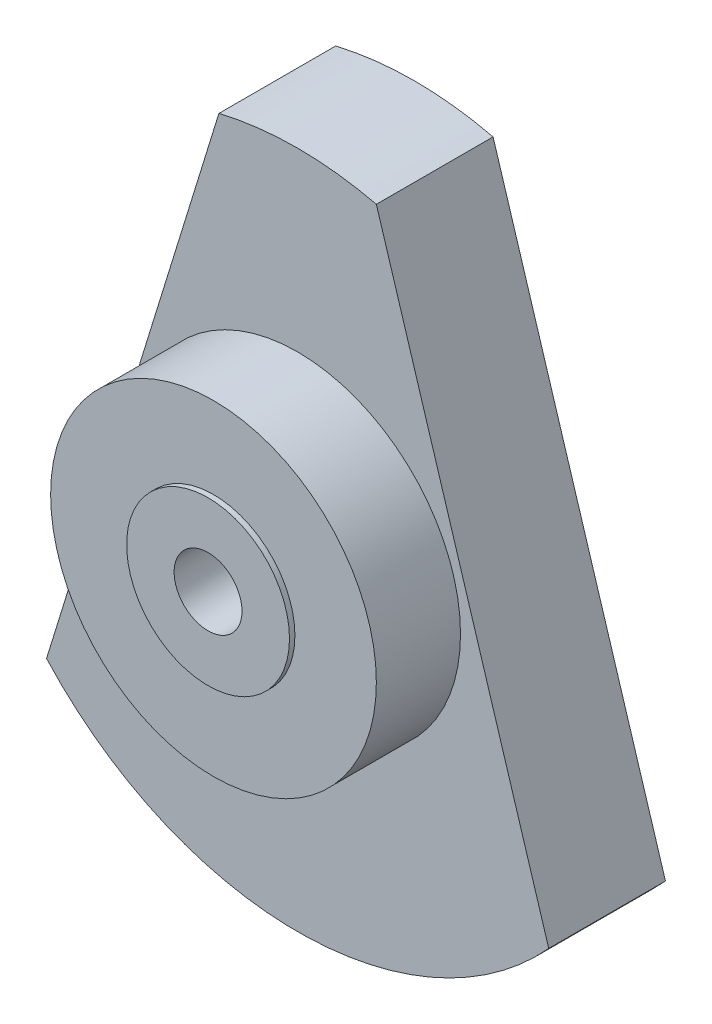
ISO-10303-21;
HEADER;
FILE_DESCRIPTION(('STEP AP214'),'2;1');
FILE_NAME('part.step','',(''),(''),'','','');
FILE_SCHEMA(('AUTOMOTIVE_DESIGN { 1 0 10303 214 1 1 1 1 }'));
ENDSEC;
DATA;
#1=APPLICATION_CONTEXT('core data for automotive mechanical design processes');
#2=APPLICATION_PROTOCOL_DEFINITION('international standard','automotive_design',2000,#1);
#3=PRODUCT_CONTEXT('',#1,'mechanical');
#4=PRODUCT('Part','Part','',(#3));
#5=PRODUCT_RELATED_PRODUCT_CATEGORY('part','',(#4));
#6=PRODUCT_DEFINITION_FORMATION('','',#4);
#7=PRODUCT_DEFINITION_CONTEXT('part definition',#1,'design');
#8=PRODUCT_DEFINITION('design','',#6,#7);
#9=PRODUCT_DEFINITION_SHAPE('','',#8);
#10=(LENGTH_UNIT() NAMED_UNIT(*) SI_UNIT(.MILLI.,.METRE.));
#11=(NAMED_UNIT(*) PLANE_ANGLE_UNIT() SI_UNIT($,.RADIAN.));
#12=(NAMED_UNIT(*) SI_UNIT($,.STERADIAN.) SOLID_ANGLE_UNIT());
#13=UNCERTAINTY_MEASURE_WITH_UNIT(LENGTH_MEASURE(1.E-05),#10,'distance_accuracy_value','');
#14=(GEOMETRIC_REPRESENTATION_CONTEXT(3) GLOBAL_UNCERTAINTY_ASSIGNED_CONTEXT((#13)) GLOBAL_UNIT_ASSIGNED_CONTEXT((#10,
#11,#12)) REPRESENTATION_CONTEXT('',''));
#15=CARTESIAN_POINT('',(0.,0.,0.));
#16=DIRECTION('',(0.,0.,1.));
#17=DIRECTION('',(1.,0.,0.));
#18=AXIS2_PLACEMENT_3D('',#15,#16,#17);
#19=CARTESIAN_POINT('',(0.,0.,3.1));
#20=DIRECTION('',(0.,0.,1.));
#21=DIRECTION('',(1.,0.,0.));
#22=AXIS2_PLACEMENT_3D('',#19,#20,#21);
#23=PLANE('',#22);
#24=CARTESIAN_POINT('',(0.,0.,3.1));
#25=DIRECTION('',(0.,0.,1.));
#26=DIRECTION('',(1.,0.,0.));
#27=AXIS2_PLACEMENT_3D('',#24,#25,#26);
#28=CIRCLE('',#27,6.);
#29=CARTESIAN_POINT('',(6.,0.,3.1));
#30=VERTEX_POINT('',#29);
#31=EDGE_CURVE('E117',#30,#30,#28,.T.);
#32=ORIENTED_EDGE('',*,*,#31,.T.);
#33=EDGE_LOOP('',(#32));
#34=FACE_BOUND('',#33,.T.);
#35=CARTESIAN_POINT('',(0.,0.,3.1));
#36=DIRECTION('',(0.,0.,1.));
#37=DIRECTION('',(1.,0.,0.));
#38=AXIS2_PLACEMENT_3D('',#35,#36,#37);
#39=CIRCLE('',#38,3.);
#40=CARTESIAN_POINT('',(3.,0.,3.1));
#41=VERTEX_POINT('',#40);
#42=EDGE_CURVE('E110',#41,#41,#39,.T.);
#43=ORIENTED_EDGE('',*,*,#42,.F.);
#44=EDGE_LOOP('',(#43));
#45=FACE_BOUND('',#44,.T.);
#46=ADVANCED_FACE('F36',(#34,#45),#23,.T.);
#47=CARTESIAN_POINT('',(0.,0.,0.));
#48=DIRECTION('',(0.,0.,1.));
#49=DIRECTION('',(1.,0.,0.));
#50=AXIS2_PLACEMENT_3D('',#47,#48,#49);
#51=PLANE('',#50);
#52=CARTESIAN_POINT('',(0.,0.,0.));
#53=DIRECTION('',(0.,0.,1.));
#54=DIRECTION('',(1.,0.,0.));
#55=AXIS2_PLACEMENT_3D('',#52,#53,#54);
#56=CIRCLE('',#55,12.5);
#57=CARTESIAN_POINT('',(-9.25,-8.40758586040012,0.));
#58=VERTEX_POINT('',#57);
#59=CARTESIAN_POINT('',(9.25,-8.40758586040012,0.));
#60=VERTEX_POINT('',#59);
#61=EDGE_CURVE('E120',#58,#60,#56,.T.);
#62=ORIENTED_EDGE('',*,*,#61,.T.);
#63=DIRECTION('',(-0.295012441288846,0.955493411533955,0.));
#64=VECTOR('',#63,1.);
#65=CARTESIAN_POINT('',(2.9,12.1589473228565,0.));
#66=LINE('',#65,#64);
#67=CARTESIAN_POINT('',(2.9,12.1589473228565,0.));
#68=VERTEX_POINT('',#67);
#69=EDGE_CURVE('E134',#60,#68,#66,.T.);
#70=ORIENTED_EDGE('',*,*,#69,.T.);
#71=CARTESIAN_POINT('',(0.,0.,0.));
#72=DIRECTION('',(0.,0.,1.));
#73=DIRECTION('',(1.,0.,0.));
#74=AXIS2_PLACEMENT_3D('',#71,#72,#73);
#75=CIRCLE('',#74,12.5);
#76=CARTESIAN_POINT('',(-2.9,12.1589473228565,0.));
#77=VERTEX_POINT('',#76);
#78=EDGE_CURVE('E137',#68,#77,#75,.T.);
#79=ORIENTED_EDGE('',*,*,#78,.T.);
#80=DIRECTION('',(-0.295012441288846,-0.955493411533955,0.));
#81=VECTOR('',#80,1.);
#82=CARTESIAN_POINT('',(-2.9,12.1589473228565,0.));
#83=LINE('',#82,#81);
#84=EDGE_CURVE('E126',#77,#58,#83,.T.);
#85=ORIENTED_EDGE('',*,*,#84,.T.);
#86=EDGE_LOOP('',(#62,#70,#79,#85));
#87=FACE_BOUND('',#86,.T.);
#88=CARTESIAN_POINT('',(0.,0.,0.));
#89=DIRECTION('',(0.,0.,1.));
#90=DIRECTION('',(1.,0.,0.));
#91=AXIS2_PLACEMENT_3D('',#88,#89,#90);
#92=CIRCLE('',#91,6.);
#93=CARTESIAN_POINT('',(6.,0.,0.));
#94=VERTEX_POINT('',#93);
#95=EDGE_CURVE('E114',#94,#94,#92,.T.);
#96=ORIENTED_EDGE('',*,*,#95,.F.);
#97=EDGE_LOOP('',(#96));
#98=FACE_BOUND('',#97,.T.);
#99=ADVANCED_FACE('F144',(#87,#98),#51,.T.);
#100=CARTESIAN_POINT('',(0.,0.,-4.3));
#101=DIRECTION('',(0.,0.,1.));
#102=DIRECTION('',(1.,0.,0.));
#103=AXIS2_PLACEMENT_3D('',#100,#101,#102);
#104=CYLINDRICAL_SURFACE('',#103,12.5);
#105=ORIENTED_EDGE('',*,*,#61,.F.);
#106=DIRECTION('',(0.,0.,1.));
#107=VECTOR('',#106,1.);
#108=CARTESIAN_POINT('',(-9.25,-8.40758586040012,-4.3));
#109=LINE('',#108,#107);
#110=CARTESIAN_POINT('',(-9.25,-8.40758586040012,-4.3));
#111=VERTEX_POINT('',#110);
#112=EDGE_CURVE('E11',#111,#58,#109,.T.);
#113=ORIENTED_EDGE('',*,*,#112,.F.);
#114=CARTESIAN_POINT('',(0.,0.,-4.3));
#115=DIRECTION('',(0.,0.,1.));
#116=DIRECTION('',(1.,0.,0.));
#117=AXIS2_PLACEMENT_3D('',#114,#115,#116);
#118=CIRCLE('',#117,12.5);
#119=CARTESIAN_POINT('',(9.25,-8.40758586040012,-4.3));
#120=VERTEX_POINT('',#119);
#121=EDGE_CURVE('E123',#111,#120,#118,.T.);
#122=ORIENTED_EDGE('',*,*,#121,.T.);
#123=DIRECTION('',(0.,0.,1.));
#124=VECTOR('',#123,1.);
#125=CARTESIAN_POINT('',(9.25,-8.40758586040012,-4.3));
#126=LINE('',#125,#124);
#127=EDGE_CURVE('E40',#120,#60,#126,.T.);
#128=ORIENTED_EDGE('',*,*,#127,.T.);
#129=EDGE_LOOP('',(#105,#113,#122,#128));
#130=FACE_BOUND('',#129,.T.);
#131=ADVANCED_FACE('F38',(#130),#104,.T.);
#132=CARTESIAN_POINT('',(-2.9,12.1589473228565,-4.3));
#133=DIRECTION('',(-0.955493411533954,0.295012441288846,0.));
#134=DIRECTION('',(-0.295012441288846,-0.955493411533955,0.));
#135=AXIS2_PLACEMENT_3D('',#132,#133,#134);
#136=PLANE('',#135);
#137=ORIENTED_EDGE('',*,*,#84,.F.);
#138=DIRECTION('',(0.,0.,1.));
#139=VECTOR('',#138,1.);
#140=CARTESIAN_POINT('',(-2.9,12.1589473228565,-4.3));
#141=LINE('',#140,#139);
#142=CARTESIAN_POINT('',(-2.9,12.1589473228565,-4.3));
#143=VERTEX_POINT('',#142);
#144=EDGE_CURVE('E46',#143,#77,#141,.T.);
#145=ORIENTED_EDGE('',*,*,#144,.F.);
#146=DIRECTION('',(-0.295012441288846,-0.955493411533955,0.));
#147=VECTOR('',#146,1.);
#148=CARTESIAN_POINT('',(-2.9,12.1589473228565,-4.3));
#149=LINE('',#148,#147);
#150=EDGE_CURVE('E130',#143,#111,#149,.T.);
#151=ORIENTED_EDGE('',*,*,#150,.T.);
#152=ORIENTED_EDGE('',*,*,#112,.T.);
#153=EDGE_LOOP('',(#137,#145,#151,#152));
#154=FACE_BOUND('',#153,.T.);
#155=ADVANCED_FACE('F146',(#154),#136,.T.);
#156=CARTESIAN_POINT('',(0.,0.,-4.3));
#157=DIRECTION('',(0.,0.,1.));
#158=DIRECTION('',(1.,0.,0.));
#159=AXIS2_PLACEMENT_3D('',#156,#157,#158);
#160=CYLINDRICAL_SURFACE('',#159,12.5);
#161=ORIENTED_EDGE('',*,*,#78,.F.);
#162=DIRECTION('',(0.,0.,1.));
#163=VECTOR('',#162,1.);
#164=CARTESIAN_POINT('',(2.9,12.1589473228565,-4.3));
#165=LINE('',#164,#163);
#166=CARTESIAN_POINT('',(2.9,12.1589473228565,-4.3));
#167=VERTEX_POINT('',#166);
#168=EDGE_CURVE('E141',#167,#68,#165,.T.);
#169=ORIENTED_EDGE('',*,*,#168,.F.);
#170=CARTESIAN_POINT('',(0.,0.,-4.3));
#171=DIRECTION('',(0.,0.,1.));
#172=DIRECTION('',(1.,0.,0.));
#173=AXIS2_PLACEMENT_3D('',#170,#171,#172);
#174=CIRCLE('',#173,12.5);
#175=EDGE_CURVE('E128',#167,#143,#174,.T.);
#176=ORIENTED_EDGE('',*,*,#175,.T.);
#177=ORIENTED_EDGE('',*,*,#144,.T.);
#178=EDGE_LOOP('',(#161,#169,#176,#177));
#179=FACE_BOUND('',#178,.T.);
#180=ADVANCED_FACE('F149',(#179),#160,.T.);
#181=CARTESIAN_POINT('',(2.9,12.1589473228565,-4.3));
#182=DIRECTION('',(0.955493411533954,0.295012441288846,0.));
#183=DIRECTION('',(-0.295012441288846,0.955493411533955,0.));
#184=AXIS2_PLACEMENT_3D('',#181,#182,#183);
#185=PLANE('',#184);
#186=ORIENTED_EDGE('',*,*,#69,.F.);
#187=ORIENTED_EDGE('',*,*,#127,.F.);
#188=DIRECTION('',(-0.295012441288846,0.955493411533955,0.));
#189=VECTOR('',#188,1.);
#190=CARTESIAN_POINT('',(2.9,12.1589473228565,-4.3));
#191=LINE('',#190,#189);
#192=EDGE_CURVE('E125',#120,#167,#191,.T.);
#193=ORIENTED_EDGE('',*,*,#192,.T.);
#194=ORIENTED_EDGE('',*,*,#168,.T.);
#195=EDGE_LOOP('',(#186,#187,#193,#194));
#196=FACE_BOUND('',#195,.T.);
#197=ADVANCED_FACE('F142',(#196),#185,.T.);
#198=CARTESIAN_POINT('',(0.,0.,-4.3));
#199=DIRECTION('',(0.,0.,1.));
#200=DIRECTION('',(1.,0.,0.));
#201=AXIS2_PLACEMENT_3D('',#198,#199,#200);
#202=PLANE('',#201);
#203=CARTESIAN_POINT('',(0.,9.,-4.3));
#204=DIRECTION('',(0.,0.,-1.));
#205=DIRECTION('',(-1.,0.,0.));
#206=AXIS2_PLACEMENT_3D('',#203,#204,#205);
#207=CIRCLE('',#206,0.999999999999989);
#208=CARTESIAN_POINT('',(-0.999999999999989,9.,-4.3));
#209=VERTEX_POINT('',#208);
#210=EDGE_CURVE('E100',#209,#209,#207,.T.);
#211=ORIENTED_EDGE('',*,*,#210,.F.);
#212=EDGE_LOOP('',(#211));
#213=FACE_BOUND('',#212,.T.);
#214=ORIENTED_EDGE('',*,*,#121,.F.);
#215=ORIENTED_EDGE('',*,*,#150,.F.);
#216=ORIENTED_EDGE('',*,*,#175,.F.);
#217=ORIENTED_EDGE('',*,*,#192,.F.);
#218=EDGE_LOOP('',(#214,#215,#216,#217));
#219=FACE_BOUND('',#218,.T.);
#220=ADVANCED_FACE('F151',(#213,#219),#202,.F.);
#221=CARTESIAN_POINT('',(0.,0.,3.1));
#222=DIRECTION('',(0.,0.,-1.));
#223=DIRECTION('',(-1.,0.,0.));
#224=AXIS2_PLACEMENT_3D('',#221,#222,#223);
#225=CYLINDRICAL_SURFACE('',#224,6.);
#226=ORIENTED_EDGE('',*,*,#31,.F.);
#227=EDGE_LOOP('',(#226));
#228=FACE_BOUND('',#227,.T.);
#229=ORIENTED_EDGE('',*,*,#95,.T.);
#230=EDGE_LOOP('',(#229));
#231=FACE_BOUND('',#230,.T.);
#232=ADVANCED_FACE('F153',(#228,#231),#225,.T.);
#233=CARTESIAN_POINT('',(0.,0.,3.3));
#234=DIRECTION('',(0.,0.,-1.));
#235=DIRECTION('',(-1.,0.,0.));
#236=AXIS2_PLACEMENT_3D('',#233,#234,#235);
#237=CYLINDRICAL_SURFACE('',#236,3.);
#238=CARTESIAN_POINT('',(0.,0.,3.3));
#239=DIRECTION('',(0.,0.,1.));
#240=DIRECTION('',(1.,0.,0.));
#241=AXIS2_PLACEMENT_3D('',#238,#239,#240);
#242=CIRCLE('',#241,3.);
#243=CARTESIAN_POINT('',(3.,0.,3.3));
#244=VERTEX_POINT('',#243);
#245=EDGE_CURVE('E111',#244,#244,#242,.T.);
#246=ORIENTED_EDGE('',*,*,#245,.F.);
#247=EDGE_LOOP('',(#246));
#248=FACE_BOUND('',#247,.T.);
#249=ORIENTED_EDGE('',*,*,#42,.T.);
#250=EDGE_LOOP('',(#249));
#251=FACE_BOUND('',#250,.T.);
#252=ADVANCED_FACE('F160',(#248,#251),#237,.T.);
#253=CARTESIAN_POINT('',(0.,0.,3.3));
#254=DIRECTION('',(0.,0.,1.));
#255=DIRECTION('',(1.,0.,0.));
#256=AXIS2_PLACEMENT_3D('',#253,#254,#255);
#257=PLANE('',#256);
#258=CARTESIAN_POINT('',(0.,0.,3.3));
#259=DIRECTION('',(0.,0.,1.));
#260=DIRECTION('',(1.,0.,0.));
#261=AXIS2_PLACEMENT_3D('',#258,#259,#260);
#262=CIRCLE('',#261,1.25);
#263=CARTESIAN_POINT('',(1.25,0.,3.3));
#264=VERTEX_POINT('',#263);
#265=EDGE_CURVE('E99',#264,#264,#262,.T.);
#266=ORIENTED_EDGE('',*,*,#265,.F.);
#267=EDGE_LOOP('',(#266));
#268=FACE_BOUND('',#267,.T.);
#269=ORIENTED_EDGE('',*,*,#245,.T.);
#270=EDGE_LOOP('',(#269));
#271=FACE_BOUND('',#270,.T.);
#272=ADVANCED_FACE('F175',(#268,#271),#257,.T.);
#273=CARTESIAN_POINT('',(0.,0.,-2.7));
#274=DIRECTION('',(0.,0.,1.));
#275=DIRECTION('',(1.,0.,0.));
#276=AXIS2_PLACEMENT_3D('',#273,#274,#275);
#277=CONICAL_SURFACE('',#276,1.25,1.02974425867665);
#278=CARTESIAN_POINT('',(0.,0.,-3.45107577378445));
#279=VERTEX_POINT('',#278);
#280=VERTEX_LOOP('',#279);
#281=FACE_BOUND('',#280,.T.);
#282=CARTESIAN_POINT('',(0.,0.,-2.7));
#283=DIRECTION('',(0.,0.,1.));
#284=DIRECTION('',(1.,0.,0.));
#285=AXIS2_PLACEMENT_3D('',#282,#283,#284);
#286=CIRCLE('',#285,1.25);
#287=CARTESIAN_POINT('',(1.25,0.,-2.7));
#288=VERTEX_POINT('',#287);
#289=EDGE_CURVE('E103',#288,#288,#286,.T.);
#290=ORIENTED_EDGE('',*,*,#289,.T.);
#291=EDGE_LOOP('',(#290));
#292=FACE_BOUND('',#291,.T.);
#293=ADVANCED_FACE('F179',(#281,#292),#277,.F.);
#294=CARTESIAN_POINT('',(0.,0.,3.3));
#295=DIRECTION('',(0.,0.,1.));
#296=DIRECTION('',(1.,0.,0.));
#297=AXIS2_PLACEMENT_3D('',#294,#295,#296);
#298=CYLINDRICAL_SURFACE('',#297,1.25);
#299=ORIENTED_EDGE('',*,*,#289,.F.);
#300=EDGE_LOOP('',(#299));
#301=FACE_BOUND('',#300,.T.);
#302=ORIENTED_EDGE('',*,*,#265,.T.);
#303=EDGE_LOOP('',(#302));
#304=FACE_BOUND('',#303,.T.);
#305=ADVANCED_FACE('F93',(#301,#304),#298,.F.);
#306=CARTESIAN_POINT('',(0.,9.,-1.3));
#307=DIRECTION('',(0.,0.,-1.));
#308=DIRECTION('',(-1.,0.,0.));
#309=AXIS2_PLACEMENT_3D('',#306,#307,#308);
#310=CONICAL_SURFACE('',#309,0.999999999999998,1.02974425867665);
#311=CARTESIAN_POINT('',(0.,9.,-0.699139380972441));
#312=VERTEX_POINT('',#311);
#313=VERTEX_LOOP('',#312);
#314=FACE_BOUND('',#313,.T.);
#315=CARTESIAN_POINT('',(0.,9.,-1.3));
#316=DIRECTION('',(0.,0.,-1.));
#317=DIRECTION('',(-1.,0.,0.));
#318=AXIS2_PLACEMENT_3D('',#315,#316,#317);
#319=CIRCLE('',#318,0.999999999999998);
#320=CARTESIAN_POINT('',(-0.999999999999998,9.,-1.3));
#321=VERTEX_POINT('',#320);
#322=EDGE_CURVE('E97',#321,#321,#319,.T.);
#323=ORIENTED_EDGE('',*,*,#322,.T.);
#324=EDGE_LOOP('',(#323));
#325=FACE_BOUND('',#324,.T.);
#326=ADVANCED_FACE('F89',(#314,#325),#310,.F.);
#327=CARTESIAN_POINT('',(0.,9.,-4.3));
#328=DIRECTION('',(0.,0.,-1.));
#329=DIRECTION('',(-1.,0.,0.));
#330=AXIS2_PLACEMENT_3D('',#327,#328,#329);
#331=CYLINDRICAL_SURFACE('',#330,0.999999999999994);
#332=ORIENTED_EDGE('',*,*,#322,.F.);
#333=EDGE_LOOP('',(#332));
#334=FACE_BOUND('',#333,.T.);
#335=ORIENTED_EDGE('',*,*,#210,.T.);
#336=EDGE_LOOP('',(#335));
#337=FACE_BOUND('',#336,.T.);
#338=ADVANCED_FACE('F92',(#334,#337),#331,.F.);
#339=CLOSED_SHELL('',(#46,#99,#131,#155,#180,#197,#220,#232,#252,#272,#293,#305,#326,#338));
#340=MANIFOLD_SOLID_BREP('B2',#339);
#341=ADVANCED_BREP_SHAPE_REPRESENTATION('',(#18,#340),#14);
#342=SHAPE_DEFINITION_REPRESENTATION(#9,#341);
ENDSEC;
END-ISO-10303-21;
